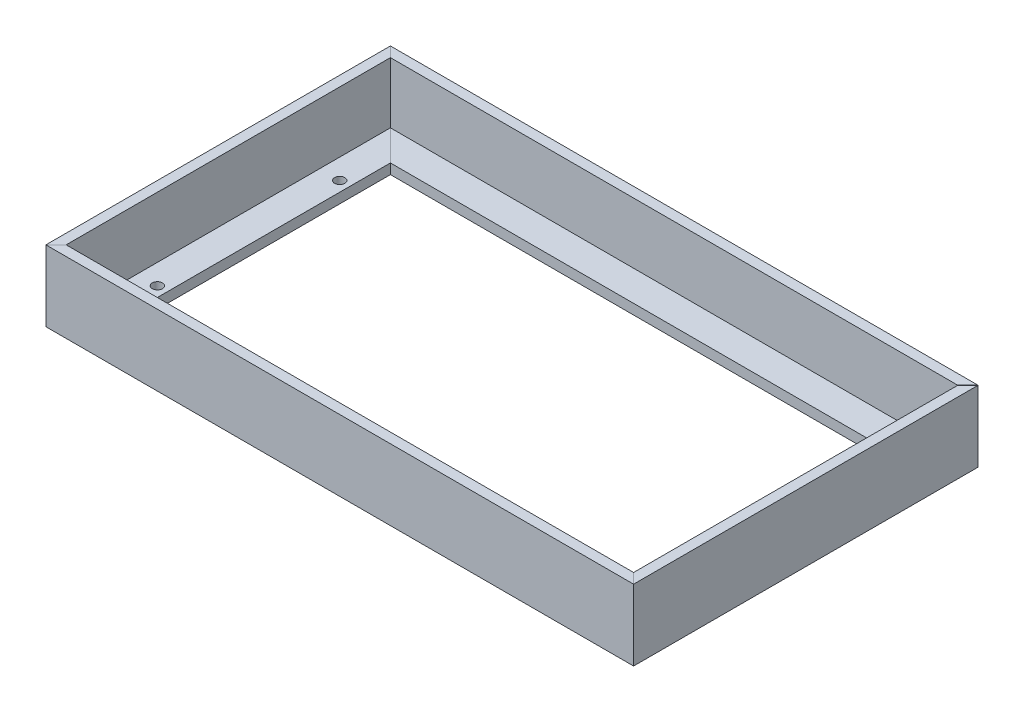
from build123d import *

# Parameters (mm, degrees)
BOSS_EXTRUDE1_DEPTH   = 53.975
BOSS_EXTRUDE1_2_DEPTH = 53.975
SKETCH2_W             = 184.15
SKETCH2_H             = 22.225
BOSS_EXTRUDE2_DEPTH   = 3.175
SKETCH3_W             = 184.15
SKETCH3_H             = 22.225
BOSS_EXTRUDE3_DEPTH   = 3.175
SKETCH4_W             = 158.75
SKETCH4_H             = 9.525
BOSS_EXTRUDE4_DEPTH   = 3.175
CUT_EXTRUDE1_DEPTH    = 194.179899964
SKETCH7_R             = 1.5875
CUT_EXTRUDE2_DEPTH    = 193.840414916


with BuildPart() as part:
    # Sketch1 → Boss-Extrude1 (new, symmetric)
    with BuildSketch(Plane.XY):
        Polygon((0, 0), (0, 22.225), (3.175, 22.225), (3.175, 3.175), (12.7, 3.175), (12.7, 0), align=None)
    extrude(amount=BOSS_EXTRUDE1_DEPTH, both=True)



with BuildPart() as body_2:
    # Sketch1 → Boss-Extrude1 2 (new, symmetric)
    with BuildSketch(Plane.XY):
        Polygon((180.975, 22.225), (184.15, 22.225), (184.15, 0), (171.45, 0), (171.45, 3.175), (180.975, 3.175), align=None)
    extrude(amount=BOSS_EXTRUDE1_2_DEPTH, both=True)


with BuildPart() as part_1:
    add(part.part)

    add(body_2.part)  # Boss-Extrude2 merges body 2
    # Sketch2 → Boss-Extrude2 (add)
    with BuildSketch(Plane.XY.offset(53.975)):
        with Locations((92.075, 11.1125)):
            Rectangle(SKETCH2_W, SKETCH2_H)
    extrude(amount=-BOSS_EXTRUDE2_DEPTH)

    # Sketch3 → Boss-Extrude3 (add)
    with BuildSketch(Plane(origin=(0, 0, -53.975), x_dir=(-1, 0, 0), z_dir=(0, 0, -1))):
        with Locations((-92.075, 11.1125)):
            Rectangle(SKETCH3_W, SKETCH3_H)
    extrude(amount=-BOSS_EXTRUDE3_DEPTH)

    # Sketch4 → Boss-Extrude4 (add)
    with BuildSketch(Plane(origin=(0, 3.175, 0), x_dir=(1, 0, 0), z_dir=(0, 1, 0))):
        with Locations((92.075, 46.0375)):
            Rectangle(SKETCH4_W, SKETCH4_H)
        with Locations((92.075, -46.0375)):
            Rectangle(SKETCH4_W, SKETCH4_H)
    extrude(amount=-BOSS_EXTRUDE4_DEPTH)

    # Sketch6 → Cut-Extrude1 (cut, through all)
    with BuildSketch(Plane(origin=(0, 22.225, 0), x_dir=(1, 0, 0), z_dir=(0, 1, 0))):
        Polygon((-0.017960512, 53.957039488), (12.682039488, 41.257039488), (12.717960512, 41.221118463), (12.753881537, 41.257039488), (12.717960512, 41.292960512), (0.017960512, 53.992960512), align=None)
        Polygon((184.167960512, 53.957039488), (184.132039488, 53.992960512), (171.432039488, 41.292960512), (171.396118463, 41.257039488), (171.432039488, 41.221118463), (171.467960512, 41.257039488), align=None)
        Polygon((184.167960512, -53.957039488), (171.467960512, -41.257039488), (171.432039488, -41.221118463), (171.396118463, -41.257039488), (171.432039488, -41.292960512), (184.132039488, -53.992960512), align=None)
        Polygon((-0.017960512, -53.957039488), (0.017960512, -53.992960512), (12.717960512, -41.292960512), (12.753881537, -41.257039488), (12.717960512, -41.221118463), (12.682039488, -41.257039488), align=None)
    extrude(amount=-CUT_EXTRUDE1_DEPTH, mode=Mode.SUBTRACT)


with BuildPart() as cut_extrude1_piece_1:
    # of the separate pieces the step leaves, piece 1, a body of its own (cut_extrude1_pieces)
    add(part_1.part.solids().sort_by_distance((0.035921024, 0, -53.975))[0])


with BuildPart() as cut_extrude1_piece_2:
    # of the separate pieces the step leaves, piece 2, a body of its own (cut_extrude1_pieces)
    add(part_1.part.solids().sort_by_distance((0.035921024, 0, 53.975))[0])


with BuildPart() as cut_extrude1_piece_3:
    # of the separate pieces the step leaves, piece 3, a body of its own (cut_extrude1_pieces)
    add(part_1.part.solids().sort_by_distance((0, 0, -53.939078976))[0])


with BuildPart() as cut_extrude1_piece_4:
    # of the separate pieces the step leaves, piece 4, a body of its own (cut_extrude1_pieces)
    add(part_1.part.solids().sort_by_distance((184.15, 0, -53.939078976))[0])


with BuildPart() as cut_extrude2_tool:
    # Sketch7 → Cut-Extrude2 (new, through all)
    with BuildSketch(Plane(origin=(0, 3.175, 0), x_dir=(1, 0, 0), z_dir=(0, 1, 0))):
        with Locations(Location((174.625, 28.575, 0), (0, 0, 180))):
            Circle(SKETCH7_R)
        with Locations(Location((174.625, -28.575, 0), (0, 0, 180))):
            Circle(SKETCH7_R)
        with Locations(Location((9.525, 28.575, 0), (0, 0, 180))):
            Circle(SKETCH7_R)
        with Locations(Location((9.525, -28.575, 0), (0, 0, 180))):
            Circle(SKETCH7_R)
    extrude(amount=-CUT_EXTRUDE2_DEPTH)


with BuildPart() as cut_extrude1_piece_3_1:
    add(cut_extrude1_piece_3.part)

    # Cut-Extrude2: cut by cut_extrude2_tool
    add(cut_extrude2_tool.part, mode=Mode.SUBTRACT)


with BuildPart() as cut_extrude1_piece_4_1:
    add(cut_extrude1_piece_4.part)

    # Cut-Extrude2: cut by cut_extrude2_tool
    add(cut_extrude2_tool.part, mode=Mode.SUBTRACT)


solid = Compound([cut_extrude1_piece_1.part, cut_extrude1_piece_2.part, cut_extrude1_piece_3_1.part, cut_extrude1_piece_4_1.part])
